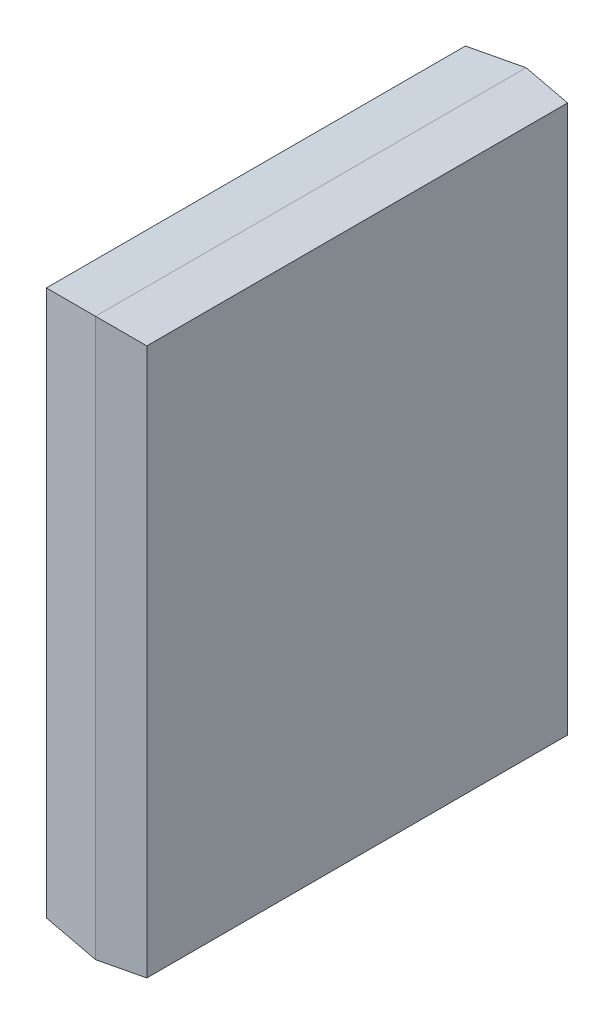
ISO-10303-21;
HEADER;
FILE_DESCRIPTION(('STEP AP214'),'2;1');
FILE_NAME('part.step','',(''),(''),'','','');
FILE_SCHEMA(('AUTOMOTIVE_DESIGN { 1 0 10303 214 1 1 1 1 }'));
ENDSEC;
DATA;
#1=APPLICATION_CONTEXT('core data for automotive mechanical design processes');
#2=APPLICATION_PROTOCOL_DEFINITION('international standard','automotive_design',2000,#1);
#3=PRODUCT_CONTEXT('',#1,'mechanical');
#4=PRODUCT('Part','Part','',(#3));
#5=PRODUCT_RELATED_PRODUCT_CATEGORY('part','',(#4));
#6=PRODUCT_DEFINITION_FORMATION('','',#4);
#7=PRODUCT_DEFINITION_CONTEXT('part definition',#1,'design');
#8=PRODUCT_DEFINITION('design','',#6,#7);
#9=PRODUCT_DEFINITION_SHAPE('','',#8);
#10=(LENGTH_UNIT() NAMED_UNIT(*) SI_UNIT(.MILLI.,.METRE.));
#11=(NAMED_UNIT(*) PLANE_ANGLE_UNIT() SI_UNIT($,.RADIAN.));
#12=(NAMED_UNIT(*) SI_UNIT($,.STERADIAN.) SOLID_ANGLE_UNIT());
#13=UNCERTAINTY_MEASURE_WITH_UNIT(LENGTH_MEASURE(1.E-05),#10,'distance_accuracy_value','');
#14=(GEOMETRIC_REPRESENTATION_CONTEXT(3) GLOBAL_UNCERTAINTY_ASSIGNED_CONTEXT((#13)) GLOBAL_UNIT_ASSIGNED_CONTEXT((#10,
#11,#12)) REPRESENTATION_CONTEXT('',''));
#15=CARTESIAN_POINT('',(0.,0.,0.));
#16=DIRECTION('',(0.,0.,1.));
#17=DIRECTION('',(1.,0.,0.));
#18=AXIS2_PLACEMENT_3D('',#15,#16,#17);
#19=CARTESIAN_POINT('',(0.,0.,0.));
#20=DIRECTION('',(0.104528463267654,0.,0.994521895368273));
#21=DIRECTION('',(0.994521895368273,0.,-0.104528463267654));
#22=AXIS2_PLACEMENT_3D('',#19,#20,#21);
#23=PLANE('',#22);
#24=DIRECTION('',(0.,-1.,0.));
#25=VECTOR('',#24,1.);
#26=CARTESIAN_POINT('',(0.,0.,0.));
#27=LINE('',#26,#25);
#28=CARTESIAN_POINT('',(0.,6.6,0.));
#29=VERTEX_POINT('',#28);
#30=CARTESIAN_POINT('',(0.,0.,0.));
#31=VERTEX_POINT('',#30);
#32=EDGE_CURVE('E416',#29,#31,#27,.T.);
#33=ORIENTED_EDGE('',*,*,#32,.T.);
#34=DIRECTION('',(-0.989132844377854,-0.103962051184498,0.103962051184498));
#35=VECTOR('',#34,1.);
#36=CARTESIAN_POINT('',(0.,0.,0.));
#37=LINE('',#36,#35);
#38=CARTESIAN_POINT('',(0.55,0.0578073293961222,-0.0578073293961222));
#39=VERTEX_POINT('',#38);
#40=EDGE_CURVE('E11',#39,#31,#37,.T.);
#41=ORIENTED_EDGE('',*,*,#40,.F.);
#42=DIRECTION('',(0.,1.,0.));
#43=VECTOR('',#42,1.);
#44=CARTESIAN_POINT('',(0.55,6.6,-0.0578073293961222));
#45=LINE('',#44,#43);
#46=CARTESIAN_POINT('',(0.55,6.54219267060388,-0.0578073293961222));
#47=VERTEX_POINT('',#46);
#48=EDGE_CURVE('E452',#47,#39,#45,.F.);
#49=ORIENTED_EDGE('',*,*,#48,.F.);
#50=DIRECTION('',(-0.989132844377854,0.103962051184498,0.103962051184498));
#51=VECTOR('',#50,1.);
#52=CARTESIAN_POINT('',(0.678693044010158,6.52866648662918,-0.0713335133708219));
#53=LINE('',#52,#51);
#54=EDGE_CURVE('E440',#47,#29,#53,.T.);
#55=ORIENTED_EDGE('',*,*,#54,.T.);
#56=EDGE_LOOP('',(#33,#41,#49,#55));
#57=FACE_BOUND('',#56,.T.);
#58=ADVANCED_FACE('F358',(#57),#23,.T.);
#59=CARTESIAN_POINT('',(0.,0.,0.));
#60=DIRECTION('',(0.104528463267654,-0.994521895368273,0.));
#61=DIRECTION('',(0.994521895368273,0.104528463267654,0.));
#62=AXIS2_PLACEMENT_3D('',#59,#60,#61);
#63=PLANE('',#62);
#64=DIRECTION('',(0.,0.,-1.));
#65=VECTOR('',#64,1.);
#66=CARTESIAN_POINT('',(0.,0.,0.));
#67=LINE('',#66,#65);
#68=CARTESIAN_POINT('',(0.,0.,-5.1));
#69=VERTEX_POINT('',#68);
#70=EDGE_CURVE('E428',#31,#69,#67,.T.);
#71=ORIENTED_EDGE('',*,*,#70,.T.);
#72=DIRECTION('',(-0.989132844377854,-0.103962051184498,-0.103962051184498));
#73=VECTOR('',#72,1.);
#74=CARTESIAN_POINT('',(0.,0.,-5.1));
#75=LINE('',#74,#73);
#76=CARTESIAN_POINT('',(0.55,0.0578073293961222,-5.04219267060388));
#77=VERTEX_POINT('',#76);
#78=EDGE_CURVE('E367',#77,#69,#75,.T.);
#79=ORIENTED_EDGE('',*,*,#78,.F.);
#80=DIRECTION('',(0.,0.,1.));
#81=VECTOR('',#80,1.);
#82=CARTESIAN_POINT('',(0.55,0.0578073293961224,0.));
#83=LINE('',#82,#81);
#84=EDGE_CURVE('E436',#39,#77,#83,.F.);
#85=ORIENTED_EDGE('',*,*,#84,.F.);
#86=ORIENTED_EDGE('',*,*,#40,.T.);
#87=EDGE_LOOP('',(#71,#79,#85,#86));
#88=FACE_BOUND('',#87,.T.);
#89=ADVANCED_FACE('F360',(#88),#63,.T.);
#90=CARTESIAN_POINT('',(0.,0.,-5.1));
#91=DIRECTION('',(0.104528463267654,0.,-0.994521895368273));
#92=DIRECTION('',(-0.994521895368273,0.,-0.104528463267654));
#93=AXIS2_PLACEMENT_3D('',#90,#91,#92);
#94=PLANE('',#93);
#95=DIRECTION('',(0.,1.,0.));
#96=VECTOR('',#95,1.);
#97=CARTESIAN_POINT('',(0.,0.,-5.1));
#98=LINE('',#97,#96);
#99=CARTESIAN_POINT('',(0.,6.6,-5.1));
#100=VERTEX_POINT('',#99);
#101=EDGE_CURVE('E433',#69,#100,#98,.T.);
#102=ORIENTED_EDGE('',*,*,#101,.T.);
#103=DIRECTION('',(-0.989132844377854,0.103962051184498,-0.103962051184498));
#104=VECTOR('',#103,1.);
#105=CARTESIAN_POINT('',(0.52444462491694,6.54487864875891,-5.04487864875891));
#106=LINE('',#105,#104);
#107=CARTESIAN_POINT('',(0.55,6.54219267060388,-5.04219267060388));
#108=VERTEX_POINT('',#107);
#109=EDGE_CURVE('E455',#108,#100,#106,.T.);
#110=ORIENTED_EDGE('',*,*,#109,.F.);
#111=DIRECTION('',(0.,-1.,0.));
#112=VECTOR('',#111,1.);
#113=CARTESIAN_POINT('',(0.55,6.6,-5.04219267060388));
#114=LINE('',#113,#112);
#115=EDGE_CURVE('E379',#77,#108,#114,.F.);
#116=ORIENTED_EDGE('',*,*,#115,.F.);
#117=ORIENTED_EDGE('',*,*,#78,.T.);
#118=EDGE_LOOP('',(#102,#110,#116,#117));
#119=FACE_BOUND('',#118,.T.);
#120=ADVANCED_FACE('F462',(#119),#94,.T.);
#121=CARTESIAN_POINT('',(0.,6.6,0.));
#122=DIRECTION('',(0.104528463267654,0.994521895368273,0.));
#123=DIRECTION('',(-0.994521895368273,0.104528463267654,0.));
#124=AXIS2_PLACEMENT_3D('',#121,#122,#123);
#125=PLANE('',#124);
#126=DIRECTION('',(0.,0.,1.));
#127=VECTOR('',#126,1.);
#128=CARTESIAN_POINT('',(0.,6.6,0.));
#129=LINE('',#128,#127);
#130=EDGE_CURVE('E451',#100,#29,#129,.T.);
#131=ORIENTED_EDGE('',*,*,#130,.T.);
#132=ORIENTED_EDGE('',*,*,#54,.F.);
#133=DIRECTION('',(0.,0.,-1.));
#134=VECTOR('',#133,1.);
#135=CARTESIAN_POINT('',(0.55,6.54219267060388,0.));
#136=LINE('',#135,#134);
#137=EDGE_CURVE('E362',#108,#47,#136,.F.);
#138=ORIENTED_EDGE('',*,*,#137,.F.);
#139=ORIENTED_EDGE('',*,*,#109,.T.);
#140=EDGE_LOOP('',(#131,#132,#138,#139));
#141=FACE_BOUND('',#140,.T.);
#142=ADVANCED_FACE('F464',(#141),#125,.T.);
#143=CARTESIAN_POINT('',(0.55,6.6,0.));
#144=DIRECTION('',(-1.,0.,0.));
#145=DIRECTION('',(0.,0.,1.));
#146=AXIS2_PLACEMENT_3D('',#143,#144,#145);
#147=PLANE('',#146);
#148=ORIENTED_EDGE('',*,*,#48,.T.);
#149=ORIENTED_EDGE('',*,*,#84,.T.);
#150=ORIENTED_EDGE('',*,*,#115,.T.);
#151=ORIENTED_EDGE('',*,*,#137,.T.);
#152=EDGE_LOOP('',(#148,#149,#150,#151));
#153=FACE_BOUND('',#152,.T.);
#154=ADVANCED_FACE('F460',(#153),#147,.F.);
#155=CARTESIAN_POINT('',(0.,0.,0.));
#156=DIRECTION('',(-0.104528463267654,0.,0.994521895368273));
#157=DIRECTION('',(0.994521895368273,0.,0.104528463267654));
#158=AXIS2_PLACEMENT_3D('',#155,#156,#157);
#159=PLANE('',#158);
#160=ORIENTED_EDGE('',*,*,#32,.F.);
#161=DIRECTION('',(0.989132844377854,0.103962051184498,0.103962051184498));
#162=VECTOR('',#161,1.);
#163=CARTESIAN_POINT('',(0.,6.6,0.));
#164=LINE('',#163,#162);
#165=CARTESIAN_POINT('',(-0.65,6.53168224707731,-0.0683177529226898));
#166=VERTEX_POINT('',#165);
#167=EDGE_CURVE('E441',#166,#29,#164,.T.);
#168=ORIENTED_EDGE('',*,*,#167,.F.);
#169=DIRECTION('',(0.,-1.,0.));
#170=VECTOR('',#169,1.);
#171=CARTESIAN_POINT('',(-0.65,0.,-0.0683177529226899));
#172=LINE('',#171,#170);
#173=CARTESIAN_POINT('',(-0.65,0.0683177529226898,-0.0683177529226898));
#174=VERTEX_POINT('',#173);
#175=EDGE_CURVE('E419',#166,#174,#172,.T.);
#176=ORIENTED_EDGE('',*,*,#175,.T.);
#177=DIRECTION('',(0.989132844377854,-0.103962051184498,0.103962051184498));
#178=VECTOR('',#177,1.);
#179=CARTESIAN_POINT('',(0.,0.,0.));
#180=LINE('',#179,#178);
#181=EDGE_CURVE('E412',#174,#31,#180,.T.);
#182=ORIENTED_EDGE('',*,*,#181,.T.);
#183=EDGE_LOOP('',(#160,#168,#176,#182));
#184=FACE_BOUND('',#183,.T.);
#185=ADVANCED_FACE('F414',(#184),#159,.T.);
#186=CARTESIAN_POINT('',(0.,6.6,0.));
#187=DIRECTION('',(-0.104528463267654,0.994521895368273,0.));
#188=DIRECTION('',(-0.994521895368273,-0.104528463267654,0.));
#189=AXIS2_PLACEMENT_3D('',#186,#187,#188);
#190=PLANE('',#189);
#191=ORIENTED_EDGE('',*,*,#130,.F.);
#192=DIRECTION('',(0.989132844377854,0.103962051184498,-0.103962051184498));
#193=VECTOR('',#192,1.);
#194=CARTESIAN_POINT('',(-0.678693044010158,6.52866648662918,-5.02866648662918));
#195=LINE('',#194,#193);
#196=CARTESIAN_POINT('',(-0.65,6.53168224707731,-5.03168224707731));
#197=VERTEX_POINT('',#196);
#198=EDGE_CURVE('E443',#197,#100,#195,.T.);
#199=ORIENTED_EDGE('',*,*,#198,.F.);
#200=DIRECTION('',(0.,0.,1.));
#201=VECTOR('',#200,1.);
#202=CARTESIAN_POINT('',(-0.65,6.53168224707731,0.));
#203=LINE('',#202,#201);
#204=EDGE_CURVE('E424',#197,#166,#203,.T.);
#205=ORIENTED_EDGE('',*,*,#204,.T.);
#206=ORIENTED_EDGE('',*,*,#167,.T.);
#207=EDGE_LOOP('',(#191,#199,#205,#206));
#208=FACE_BOUND('',#207,.T.);
#209=ADVANCED_FACE('F467',(#208),#190,.T.);
#210=CARTESIAN_POINT('',(0.,0.,-5.1));
#211=DIRECTION('',(-0.104528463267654,0.,-0.994521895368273));
#212=DIRECTION('',(-0.994521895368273,0.,0.104528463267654));
#213=AXIS2_PLACEMENT_3D('',#210,#211,#212);
#214=PLANE('',#213);
#215=ORIENTED_EDGE('',*,*,#101,.F.);
#216=DIRECTION('',(0.989132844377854,-0.103962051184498,-0.103962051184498));
#217=VECTOR('',#216,1.);
#218=CARTESIAN_POINT('',(-0.52444462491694,0.0551213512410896,-5.04487864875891));
#219=LINE('',#218,#217);
#220=CARTESIAN_POINT('',(-0.65,0.0683177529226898,-5.03168224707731));
#221=VERTEX_POINT('',#220);
#222=EDGE_CURVE('E423',#221,#69,#219,.T.);
#223=ORIENTED_EDGE('',*,*,#222,.F.);
#224=DIRECTION('',(0.,1.,0.));
#225=VECTOR('',#224,1.);
#226=CARTESIAN_POINT('',(-0.65,0.,-5.03168224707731));
#227=LINE('',#226,#225);
#228=EDGE_CURVE('E475',#221,#197,#227,.T.);
#229=ORIENTED_EDGE('',*,*,#228,.T.);
#230=ORIENTED_EDGE('',*,*,#198,.T.);
#231=EDGE_LOOP('',(#215,#223,#229,#230));
#232=FACE_BOUND('',#231,.T.);
#233=ADVANCED_FACE('F480',(#232),#214,.T.);
#234=CARTESIAN_POINT('',(0.,0.,0.));
#235=DIRECTION('',(-0.104528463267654,-0.994521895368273,0.));
#236=DIRECTION('',(0.994521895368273,-0.104528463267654,0.));
#237=AXIS2_PLACEMENT_3D('',#234,#235,#236);
#238=PLANE('',#237);
#239=ORIENTED_EDGE('',*,*,#70,.F.);
#240=ORIENTED_EDGE('',*,*,#181,.F.);
#241=DIRECTION('',(0.,0.,-1.));
#242=VECTOR('',#241,1.);
#243=CARTESIAN_POINT('',(-0.65,0.0683177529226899,0.));
#244=LINE('',#243,#242);
#245=EDGE_CURVE('E446',#174,#221,#244,.T.);
#246=ORIENTED_EDGE('',*,*,#245,.T.);
#247=ORIENTED_EDGE('',*,*,#222,.T.);
#248=EDGE_LOOP('',(#239,#240,#246,#247));
#249=FACE_BOUND('',#248,.T.);
#250=ADVANCED_FACE('F429',(#249),#238,.T.);
#251=CARTESIAN_POINT('',(-0.65,6.6,0.));
#252=DIRECTION('',(-1.,0.,0.));
#253=DIRECTION('',(0.,0.,1.));
#254=AXIS2_PLACEMENT_3D('',#251,#252,#253);
#255=PLANE('',#254);
#256=ORIENTED_EDGE('',*,*,#175,.F.);
#257=ORIENTED_EDGE('',*,*,#204,.F.);
#258=ORIENTED_EDGE('',*,*,#228,.F.);
#259=ORIENTED_EDGE('',*,*,#245,.F.);
#260=EDGE_LOOP('',(#256,#257,#258,#259));
#261=FACE_BOUND('',#260,.T.);
#262=ADVANCED_FACE('F472',(#261),#255,.T.);
#263=CLOSED_SHELL('',(#58,#89,#120,#142,#154,#185,#209,#233,#250,#262));
#264=MANIFOLD_SOLID_BREP('B2',#263);
#265=ADVANCED_BREP_SHAPE_REPRESENTATION('',(#18,#264),#14);
#266=SHAPE_DEFINITION_REPRESENTATION(#9,#265);
ENDSEC;
END-ISO-10303-21;
